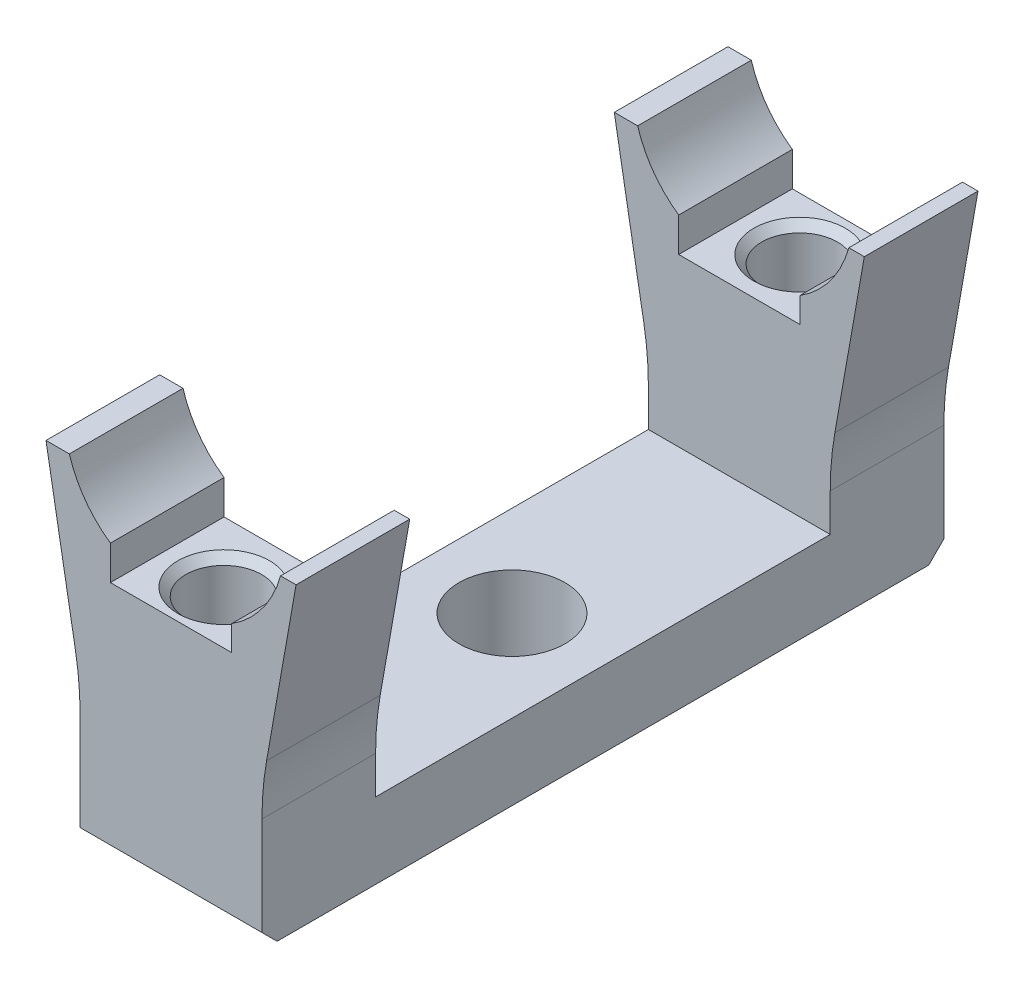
from build123d import *

# Parameters (mm, degrees)
SKETCH_1_W                   = 12
SKETCH_1_H                   = 5
EXTRUDE_3_DEPTH              = 45
SKETCH_4_W                   = 30
SKETCH_4_H                   = 20.698157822
CUT_EXTRUDE_1_DEPTH          = 22.5
SKETCH_5_R                   = 3.5
CUT_EXTRUDE_2_DEPTH          = 22.5
HOLE_WIZARD_M6_1_D           = 5
HOLE_WIZARD_M6_1_DEPTH       = 12
HOLE_WIZARD_M6_1_CSINK_D     = 6.05
HOLE_WIZARD_M6_1_CSINK_ANGLE = 90
HOLE_WIZARD_M6_1_TIP         = 1.502151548
CHAMFER_2_SIZE               = 1


with BuildPart() as part:
    # Sketch 1 → Extrude 3 (new body)
    with BuildSketch(Plane.XY):
        with Locations((0, 2.5)):
            Rectangle(SKETCH_1_W, SKETCH_1_H)
        with BuildLine():
            Line((-6, 7.489842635), (-6, 5))
            Line((-6, 5), (6, 5))
            Line((6, 5), (6, 7.489842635))
            ThreePointArc((6, 7.489842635), (6.076106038, 9.23295749), (6.30384494, 10.962806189))
            Line((6.30384494, 10.962806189), (8.25, 22))
            Line((8.25, 22), (7.228416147, 22))
            ThreePointArc((7.228416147, 22), (6.019762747, 19.526471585), (4, 17.65571123))
            Line((4, 17.65571123), (4, 16))
            Line((4, 16), (-4, 16))
            Line((-4, 16), (-4, 18.255437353))
            ThreePointArc((-4, 18.255437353), (-5.672023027, 19.8977866), (-6.708203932, 22))
            Line((-6.708203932, 22), (-8.25, 22))
            Line((-8.25, 22), (-6.30384494, 10.962806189))
            ThreePointArc((-6.30384494, 10.962806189), (-6.076106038, 9.23295749), (-6, 7.489842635))
        make_face()
    extrude(amount=EXTRUDE_3_DEPTH)

    # Sketch 4 → Cut-Extrude 1 (cut, symmetric)
    with BuildSketch(Plane(origin=(0, 0, 0), x_dir=(0, 0, -1), z_dir=(1, 0, 0))):
        with Locations((-22.5, 15.349078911)):
            Rectangle(SKETCH_4_W, SKETCH_4_H)
    extrude(amount=CUT_EXTRUDE_1_DEPTH, both=True, mode=Mode.SUBTRACT)

    # Sketch 5 → Cut-Extrude 2 (cut, symmetric)
    with BuildSketch(Plane(origin=(0, 5, 0), x_dir=(1, 0, 0), z_dir=(0, 1, 0))):
        with Locations(Location((0, -22.5, 0), (0, 0, 270))):
            Circle(SKETCH_5_R)
    extrude(amount=CUT_EXTRUDE_2_DEPTH, both=True, mode=Mode.SUBTRACT)

    # Hole Wizard M6 _1
    with Locations(Plane(origin=(0, 16, 0), x_dir=(1, 0, 0), z_dir=(0, 1, 0))):
        with Locations((0, -41.521145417), (0, -3.521145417)):
            CounterSinkHole(HOLE_WIZARD_M6_1_D / 2, HOLE_WIZARD_M6_1_CSINK_D / 2, depth=HOLE_WIZARD_M6_1_DEPTH, counter_sink_angle=HOLE_WIZARD_M6_1_CSINK_ANGLE)
            with Locations((0, 0, -(HOLE_WIZARD_M6_1_DEPTH + HOLE_WIZARD_M6_1_TIP / 2))):  # 118° drill point
                Cone(0, HOLE_WIZARD_M6_1_D / 2, HOLE_WIZARD_M6_1_TIP, mode=Mode.SUBTRACT)

    # Chamfer 2
    chamfer_2_edges = [part.edges().sort_by_distance(p)[0] for p in [
        (0, 0, 0),
        (0, 0, 45),
    ]]
    chamfer(chamfer_2_edges, length=CHAMFER_2_SIZE)


solid = part.part
